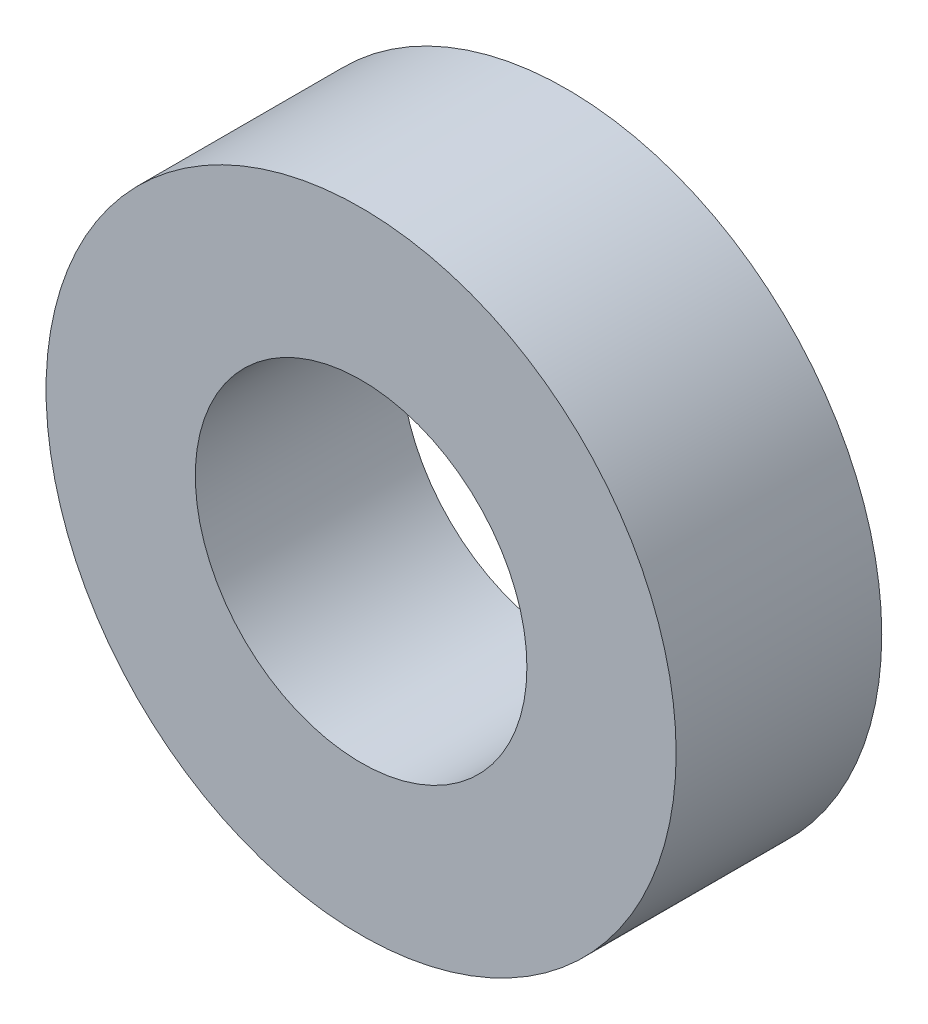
from build123d import *

# Parameters (mm, degrees)
SKETCH1_R          = 4.75
EXTRUDE1_DEPTH     = 3.1
SKETCH2_R          = 2.5
CUT_EXTRUDE1_DEPTH = 8.398310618


with BuildPart() as part:
    # Sketch1 → Extrude1 (new body)
    with BuildSketch(Plane.XY):
        Circle(SKETCH1_R)
    extrude(amount=-EXTRUDE1_DEPTH)

    # Sketch2 → Cut-Extrude1 (cut, through all)
    with BuildSketch(Plane.XY):
        Circle(SKETCH2_R)
    extrude(amount=-CUT_EXTRUDE1_DEPTH, mode=Mode.SUBTRACT)


solid = part.part
